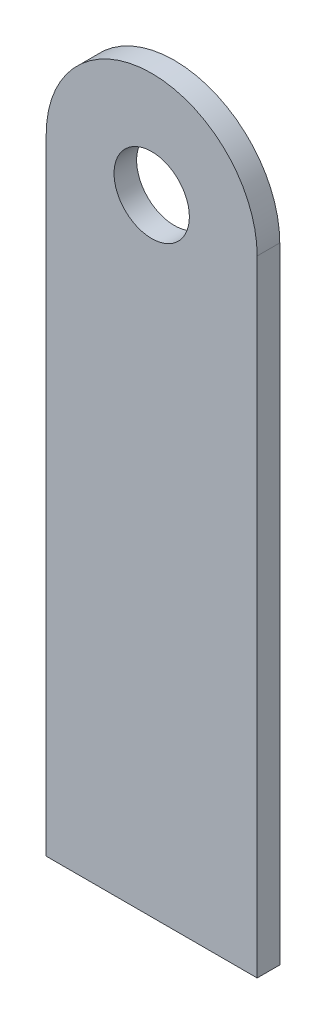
from build123d import *

# Parameters (mm, degrees)
ESQUISSE1_R      = 0.5
EXTRUSION1_DEPTH = 0.3


with BuildPart() as part:
    # Esquisse1 → Extrusion1 (new body)
    with BuildSketch(Plane.XY):
        with BuildLine():
            Line((0, 0), (2.8, 0))
            Line((2.8, 0), (2.8, 8.3))
            ThreePointArc((2.8, 8.3), (1.4, 9.7), (0, 8.3))
            Line((0, 8.3), (0, 0))
        make_face()
        with Locations((1.4, 8.3)):
            Circle(ESQUISSE1_R, mode=Mode.SUBTRACT)
    extrude(amount=EXTRUSION1_DEPTH)


solid = part.part
